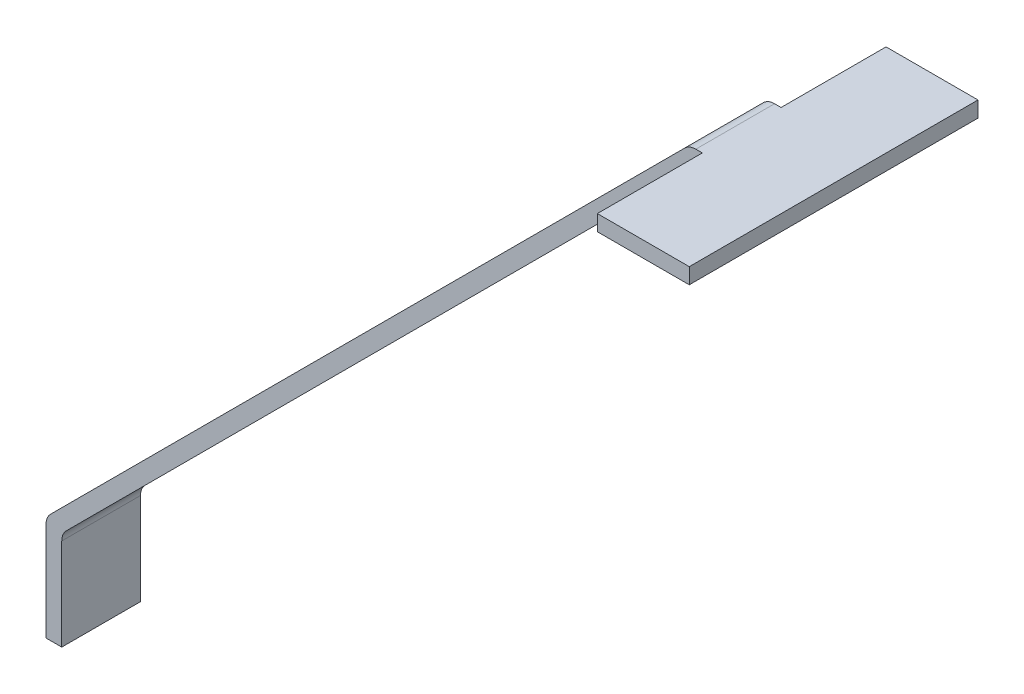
from build123d import *

# Parameters (mm, degrees)
BOSS_EXTRUDE1_DEPTH = 15
FILLET3_R           = 3
SKETCH3_W           = 17.514718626
SKETCH3_H           = 3
BOSS_EXTRUDE2_DEPTH = 20
SKETCH5_W           = 17.514718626
SKETCH5_H           = 3
BOSS_EXTRUDE3_DEPTH = 20


with BuildPart() as part:
    # Sketch2 → Boss-Extrude1 (new body)
    with BuildSketch(Plane.XY):
        Polygon((0, 0), (122.54160518, 122.54160518), (142.54160518, 122.54160518), (142.54160518, 119.54160518), (123.784245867, 119.54160518), (3, -1.242640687), (3, -20), (0, -20), align=None)
    extrude(amount=BOSS_EXTRUDE1_DEPTH)

    # Fillet3
    fillet3_edges = [part.edges().sort_by_distance(p)[0] for p in [
        (0, 0, 7.5),
        (122.54160518, 122.54160518, 7.5),
        (123.784245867, 119.54160518, 7.5),
        (3, -1.242640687, 7.5),
    ]]
    fillet(fillet3_edges, radius=FILLET3_R)

    # Sketch3 → Boss-Extrude2 (add)
    with BuildSketch(Plane.XY.offset(15)):
        with Locations((133.784245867, 121.04160518)):
            Rectangle(SKETCH3_W, SKETCH3_H)
    extrude(amount=BOSS_EXTRUDE2_DEPTH)

    # Sketch5 → Boss-Extrude3 (add)
    with BuildSketch(Plane(origin=(0, 0, 0), x_dir=(-1, 0, 0), z_dir=(0, 0, -1))):
        with Locations((-133.784245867, 121.04160518)):
            Rectangle(SKETCH5_W, SKETCH5_H)
    extrude(amount=BOSS_EXTRUDE3_DEPTH)


solid = part.part
